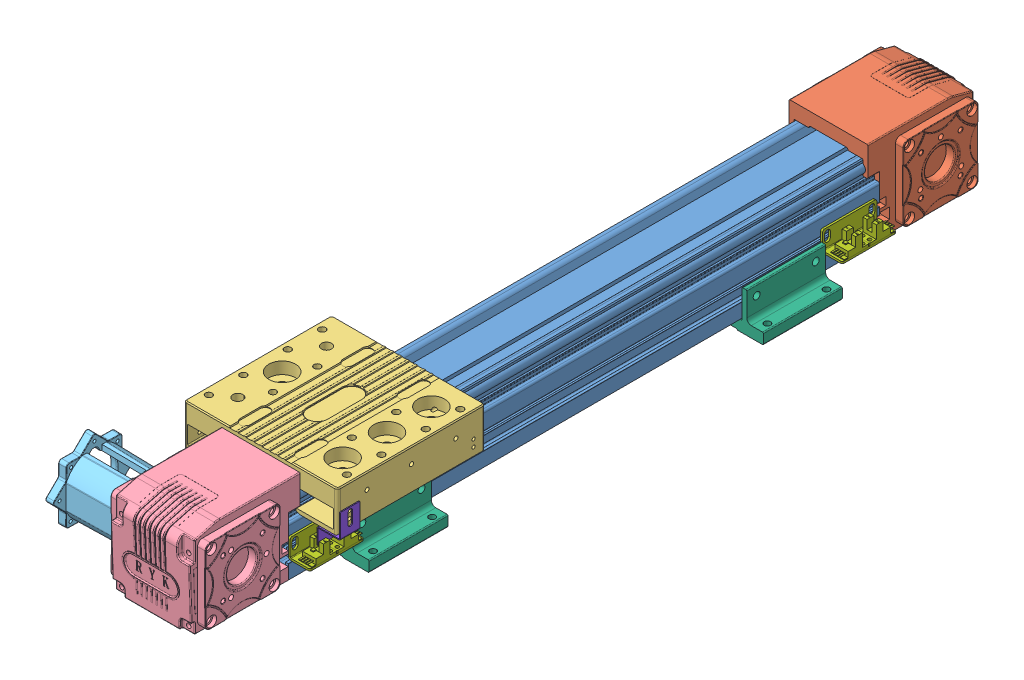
SolidWorks assembly RYK80-直连.SLDASM, configuration 默认 (file format 9000). Lengths in mm.
Overall size (189.8 105.5 803.37).
17 component instances, 12 part files, 49 mates.
Components (placement in the parent):
- RYK80欧规皮带模组型材底座-1: RYK80欧规皮带模组型材底座.SLDPRT [默认] at (-214.5114 -116.5275 500) size (80 74.5 600)
- RYK80-欧规副同步座-1: RYK80-欧规副同步座.SLDPRT [默认] at (-25.626 6.7076 546) x (-1 0 0) z (0 0 -1) size (96.14 90.46 113.69)
- RYK80欧规同步带模组滑块-1: RYK80欧规同步带模组滑块.SLDPRT [默认] at (-48.6835 40.0257 857) size (156 41.56 150)
- RYK80-欧规主同步端-1A出轴-1: RYK80-欧规主同步端-1A出轴.SLDPRT [默认] at (-45.0567 6.7076 1054) size (124.16 90.46 113.69)
- 57-60电机座-1: 57-60电机座.SLDPRT [默认] at (-86.2413 7.3679 1154) x (0 -0.008727 -0.999962) z (-1 0 0) size (83.09 83.08 62.81)
- RYK80-欧规主同步端-2B出轴-1: RYK80-欧规主同步端-2B出轴.SLDPRT [默认] at (-45.0567 6.7076 1054) (suppressed, hidden)
- 57-60电机座-3: 57-60电机座.SLDPRT [默认] at (15.5587 7.3679 1154) x (0 0.999962 0.008727) z (1 0 0) size (83.09 83.08 62.81) (suppressed, hidden)
- RYK80-欧规主同步端-双出轴-1: RYK80-欧规主同步端-双出轴.SLDPRT [默认] at (-45.0567 6.7076 1054) (suppressed, hidden)
- 57-60电机座-4: 57-60电机座.SLDPRT [默认] at (15.5587 7.3679 1154) x (0 0.999962 0.008727) z (1 0 0) size (83.09 83.08 62.81) (suppressed, hidden)
- 57-60电机座-5: 57-60电机座.SLDPRT [默认] at (-86.2413 7.3679 1154) x (0 -0.008727 -0.999962) z (-1 0 0) size (83.09 83.08 62.81) (suppressed, hidden)
- RY80欧规地脚-1: RY80欧规地脚.SLDPRT [默认] at (-35.3413 -46.6321 1040) x (0 0 -1) z (1 0 0) size (80 40 124)
- RY80欧规地脚-2: RY80欧规地脚.SLDPRT [默认] at (-35.3413 -46.6321 640) x (0 0 -1) z (1 0 0) size (80 40 124)
- RYK60 欧规光电安装座-1: RYK60 欧规光电安装座.SLDPRT [默认] at (-55.7216 6.9235 1517.0757) x (-1 0 0) z (0 0 -1) size (22 20 55.4)
- 80欧规光电感应片-1: 80欧规光电感应片.SLDPRT [默认] at (43.6587 36.8679 1066) x (0 0 1) z (-1 0 0) size (20 41 24)
- RYK60 欧规光电安装座-2: RYK60 欧规光电安装座.SLDPRT [默认] at (-55.7216 6.9235 977.0757) x (-1 0 0) z (0 0 -1) size (22 20 55.4)
- 750W电机标准转接板-1: 750W电机标准转接板.SLDPRT [默认] at (-146.1413 7.3679 1154) x (0 0.71325 0.700909) z (0 -0.700909 0.71325) (suppressed, hidden)
- 86电机转接板-M5-1: 86电机转接板-M5.SLDPRT [默认] at (-146.1413 7.3679 1154) x (0 -0.700909 0.71325) z (-1 0 0) (suppressed, hidden)
Mates (geometry in assembly coordinates):
- 重合1: coincident anti-aligned: plane of RYK80欧规皮带模组型材底座-1 through (-55.0601 28.8679 1100) normal (0 0 1); plane of RYK80-欧规主同步端-2B出轴-1 through (-35.3413 -36.6321 1100) normal (0 0 -1)
- 宽度1: width aligned: plane of RYK80欧规皮带模组型材底座-1 through (4.6586 -35.1321 1100) normal (1 0 0); plane of RYK80欧规皮带模组型材底座-1 through (-75.3413 -20.9321 1100) normal (-1 0 0); plane of RYK80-欧规主同步端-2B出轴-1 through (4.6587 -36.6321 1192) normal (1 0 0); plane of RYK80-欧规主同步端-2B出轴-1 through (-75.3413 -36.6321 1192) normal (-1 0 0)
- 重合9: coincident aligned: plane of RYK80欧规皮带模组型材底座-1 through (-63.5413 -36.6321 1100) normal (0 -1 0); plane of RYK80-欧规主同步端-2B出轴-1 through (-35.3413 -36.6321 1192) normal (0 -1 0)
- 重合10: coincident aligned: plane of RYK80欧规皮带模组型材底座-1 through (-63.5413 -36.6321 1100) normal (0 -1 0); plane of RYK80-欧规主同步端-双出轴-1 through (-35.3413 -36.6321 1192) normal (0 -1 0)
- 宽度2: width aligned: plane of RYK80欧规皮带模组型材底座-1 through (-75.3413 -20.9321 1100) normal (-1 0 0); plane of RYK80欧规皮带模组型材底座-1 through (4.6586 -35.1321 1100) normal (1 0 0); plane of RYK80-欧规主同步端-双出轴-1 through (-75.3413 -36.6321 1192) normal (-1 0 0); plane of RYK80-欧规主同步端-双出轴-1 through (4.6587 -36.6321 1192) normal (1 0 0)
- 重合11: coincident anti-aligned: plane of RYK80欧规皮带模组型材底座-1 through (-55.0601 28.8679 1100) normal (0 0 1); plane of RYK80-欧规主同步端-双出轴-1 through (-35.3413 -36.6321 1100) normal (0 0 -1)
- 重合12: coincident anti-aligned: plane of RYK80欧规皮带模组型材底座-1 through (-55.0601 28.8679 1100) normal (0 0 1); plane of RYK80-欧规主同步端-1A出轴-1 through (-35.3413 -36.6321 1100) normal (0 0 -1)
- 宽度3: width anti-aligned: plane of RYK80欧规皮带模组型材底座-1 through (4.6586 -35.1321 1100) normal (1 0 0); plane of RYK80欧规皮带模组型材底座-1 through (-75.3413 -20.9321 1100) normal (-1 0 0); plane of RYK80-欧规主同步端-1A出轴-1 through (-75.3413 -36.6321 1192) normal (-1 0 0); plane of RYK80-欧规主同步端-1A出轴-1 through (4.6587 -36.6321 1192) normal (1 0 0)
- 重合13: coincident aligned: plane of RYK80欧规皮带模组型材底座-1 through (-63.5413 -36.6321 1100) normal (0 -1 0); plane of RYK80-欧规主同步端-1A出轴-1 through (-35.3413 -36.6321 1192) normal (0 -1 0)
- 重合14: coincident anti-aligned: plane of RYK80欧规皮带模组型材底座-1 through (-55.0601 28.8679 500) normal (0 0 -1); plane of RYK80-欧规副同步座-1 through (-35.3413 -36.6321 500) normal (0 0 1)
- 重合15: coincident aligned: plane of RYK80欧规皮带模组型材底座-1 through (-21.3414 -36.6321 1100) normal (0 -1 0); plane of RYK80-欧规副同步座-1 through (-35.3413 -36.6321 408) normal (0 -1 0)
- 宽度4: width anti-aligned: plane of RYK80欧规皮带模组型材底座-1 through (4.6586 -35.1321 1100) normal (1 0 0); plane of RYK80欧规皮带模组型材底座-1 through (-75.3413 -20.9321 1100) normal (-1 0 0); plane of RYK80-欧规副同步座-1 through (-75.3413 -36.6321 408) normal (-1 0 0); plane of RYK80-欧规副同步座-1 through (4.6587 -36.6321 408) normal (1 0 0)
- 重合16: coincident anti-aligned: plane of RYK80欧规皮带模组型材底座-1 through (-63.5413 -36.6321 1100) normal (0 -1 0); plane of RY80欧规地脚-1 through (-75.4913 -36.6321 960) normal (0 1 0)
- 宽度5: width anti-aligned: plane of RY80欧规地脚-1 through (9.8087 -36.6321 960) normal (1 0 0); plane of RY80欧规地脚-1 through (-80.4913 -36.6321 960) normal (-1 0 0); plane of RYK80欧规皮带模组型材底座-1 through (-75.3413 -20.9321 1100) normal (-1 0 0); plane of RYK80欧规皮带模组型材底座-1 through (4.6586 -35.1321 1100) normal (1 0 0)
- 重合17: coincident aligned: plane of RY80欧规地脚-1 through (9.8087 -36.6321 960) normal (1 0 0); plane of RY80欧规地脚-2 through (9.8087 -36.6321 560) normal (1 0 0)
- 重合18: coincident aligned: plane of RY80欧规地脚-1 through (0.3589 -47.6321 960) normal (0 -1 0); plane of RY80欧规地脚-2 through (0.3589 -47.6321 560) normal (0 -1 0)
- 距离3: distance = 60 mm aligned: plane of RYK80欧规皮带模组型材底座-1 through (-55.0601 28.8679 1100) normal (0 0 1); plane of RY80欧规地脚-1 through (-35.3413 -46.6321 1040) normal (0 0 1)
- 距离4: distance = 60 mm aligned: plane of RYK80欧规皮带模组型材底座-1 through (-55.0601 28.8679 500) normal (0 0 -1); plane of RY80欧规地脚-2 through (-35.3413 -46.6321 560) normal (0 0 -1)
- 重合24: coincident anti-aligned: plane of RYK80欧规皮带模组型材底座-1 through (4.6586 -35.1321 1100) normal (1 0 0); plane of RYK60 欧规光电安装座-1 through (4.6586 3.3679 1045) normal (-1 0 0)
- 距离7: distance = 20 mm aligned: plane of RYK60 欧规光电安装座-1 through (4.6586 -16.6321 1045) normal (0 -1 0); plane of RYK80欧规皮带模组型材底座-1 through (-21.3414 -36.6321 1100) normal (0 -1 0)
- 重合32: coincident aligned: plane of RYK60 欧规光电安装座-1 through (4.6586 -16.6321 1045) normal (0 -1 0); plane of RYK60 欧规光电安装座-2 through (4.6586 -16.6321 505) normal (0 -1 0)
- 重合33: coincident aligned: plane of RYK60 欧规光电安装座-1 through (26.6586 -16.6321 1045) normal (1 0 0); plane of RYK60 欧规光电安装座-2 through (26.6586 -16.6321 505) normal (1 0 0)
- 距离8: distance = 5 mm aligned: plane of RYK60 欧规光电安装座-2 through (6.6586 -13.8955 505) normal (0 0 -1); plane of RYK80欧规皮带模组型材底座-1 through (-55.0601 28.8679 500) normal (0 0 -1)
- 重合35: coincident anti-aligned: plane of RYK80-欧规主同步端-1A出轴-1 through (-83.3413 7.3679 1154) normal (-1 0 0); plane of 57-60电机座-1 through (-83.3413 7.3679 1154) normal (1 0 0)
- 同心1: concentric anti-aligned: cylinder of RYK80-欧规主同步端-1A出轴-1 through (-111.3413 7.3679 1154) axis (1 0 0) radius 9.5; cone of 57-60电机座-1 through (-93.2413 7.3679 1154) axis (-1 0 0)
- 同心2: concentric anti-aligned: cylinder of RYK80-欧规主同步端-1A出轴-1 through (-83.3413 -4.6321 1174.7846) axis (-1 0 0) radius 2.5; cone of 57-60电机座-1 through (-83.2413 -4.6321 1174.7846) axis (1 0 0)
- 重合36: coincident anti-aligned: plane of 57-60电机座-1 through (-146.1413 7.3679 1154) normal (-1 0 0); plane of 750W电机标准转接板-1 through (-146.1413 7.3679 1154) normal (1 0 0)
- 同心3: concentric aligned: cone of 57-60电机座-1 through (-92.9263 7.3679 1154) axis (1 0 0); cylinder of 750W电机标准转接板-1 through (-194.1413 7.3679 1154) axis (1 0 0) radius 22.5
- 同心4: concentric aligned: cylinder of 57-60电机座-1 through (-138.2413 7.0624 1119.0013) axis (-1 0 0) radius 1.6; circle of 750W电机标准转接板-1
- 重合37: coincident anti-aligned: plane of 57-60电机座-1 through (-146.1413 7.3679 1154) normal (-1 0 0); plane of 86电机转接板-M5-1 through (-146.1413 -49.1985 1154.4936) normal (1 0 0)
- 同心5: concentric anti-aligned: cone of 57-60电机座-1 through (-92.9263 7.3679 1154) axis (1 0 0); cylinder of 86电机转接板-M5-1 through (-146.1413 7.3679 1154) axis (-1 0 0) radius 23
- 同心6: concentric aligned: cylinder of 57-60电机座-1 through (-138.2413 7.0624 1119.0013) axis (-1 0 0) radius 1.6; circle of 86电机转接板-M5-1
- 距离9: distance = 105.5 mm anti-aligned: plane of RYK80欧规同步带模组滑块-1 through (-117.8382 57.8679 940.5) normal (0 1 0); plane of RY80欧规地脚-1 through (-71.0415 -47.6321 960) normal (0 -1 0)
- 宽度6: width aligned: plane of RYK80欧规同步带模组滑块-1 through (-113.3413 35.9974 1085.5) normal (-1 0 0); plane of RYK80欧规同步带模组滑块-1 through (42.6587 17.8079 1085.5) normal (1 0 0); plane of RYK80欧规皮带模组型材底座-1 through (-75.3413 -20.9321 1100) normal (-1 0 0); plane of RYK80欧规皮带模组型材底座-1 through (4.6586 -35.1321 1100) normal (1 0 0)
- 重合39: coincident anti-aligned: plane of RYK80欧规同步带模组滑块-1 through (-104.3413 47.7679 1088) normal (0 0 1); plane of RYK80-欧规主同步端-1A出轴-1 through (-35.3413 38.3679 1088) normal (0 0 -1)
- 重合40: coincident anti-aligned: plane of RYK80欧规同步带模组滑块-1 through (42.6587 17.8079 1085.5) normal (1 0 0); plane of 80欧规光电感应片-1 through (42.6587 36.8679 1086) normal (-1 0 0)
- 距离10: distance = 2 mm aligned: plane of 80欧规光电感应片-1 through (21.3953 11.1313 1086) normal (0 0 1); plane of RYK80欧规同步带模组滑块-1 through (-104.3413 47.7679 1088) normal (0 0 1)
- 距离11: distance = 21 mm aligned: plane of 80欧规光电感应片-1 through (42.6587 36.8679 1086) normal (0 1 0); plane of RYK80欧规同步带模组滑块-1 through (-117.8382 57.8679 940.5) normal (0 1 0)
- 重合44: coincident anti-aligned: plane of RYK80欧规同步带模组滑块-1 through (-104.3413 47.7679 1088) normal (0 0 1); plane of RYK80-欧规主同步端-2B出轴-1 through (-35.3413 38.3679 1088) normal (0 0 -1)
- 重合45: coincident anti-aligned: plane of RYK80-欧规主同步端-2B出轴-1 through (12.6587 7.3679 1154) normal (1 0 0); plane of 57-60电机座-3 through (12.6587 7.3679 1154) normal (-1 0 0)
- 同心7: concentric anti-aligned: cylinder of RYK80-欧规主同步端-2B出轴-1 through (40.6587 7.3679 1154) axis (-1 0 0) radius 9.5; cone of 57-60电机座-3 through (22.5587 7.3679 1154) axis (1 0 0)
- 同心8: concentric anti-aligned: cylinder of RYK80-欧规主同步端-2B出轴-1 through (12.6587 -13.4168 1166) axis (1 0 0) radius 2.5; cone of 57-60电机座-3 through (12.5587 -13.4168 1166) axis (-1 0 0)
- 重合46: coincident anti-aligned: plane of RYK80-欧规主同步端-双出轴-1 through (12.6587 7.3679 1154) normal (1 0 0); plane of 57-60电机座-4 through (12.6587 7.3679 1154) normal (-1 0 0)
- 同心9: concentric aligned: cylinder of RYK80-欧规主同步端-双出轴-1 through (40.6587 7.3679 1154) axis (-1 0 0) radius 9.5; cone of 57-60电机座-4 through (22.2436 7.3679 1154) axis (-1 0 0)
- 重合47: coincident anti-aligned: plane of RYK80-欧规主同步端-双出轴-1 through (-83.3413 7.3679 1154) normal (-1 0 0); plane of 57-60电机座-5 through (-83.3413 7.3679 1154) normal (1 0 0)
- 同心10: concentric anti-aligned: cylinder of RYK80-欧规主同步端-双出轴-1 through (-111.3413 7.3679 1154) axis (1 0 0) radius 9.5; cone of 57-60电机座-5 through (-93.2413 7.3679 1154) axis (-1 0 0)
- 同心11: concentric anti-aligned: cylinder of RYK80-欧规主同步端-双出轴-1 through (-83.3413 -4.6321 1133.2154) axis (-1 0 0) radius 2.5; cone of 57-60电机座-5 through (-83.2413 -4.6321 1133.2154) axis (1 0 0)
- 重合48: coincident anti-aligned: plane of RYK80欧规同步带模组滑块-1 through (-104.3413 47.7679 1088) normal (0 0 1); plane of RYK80-欧规主同步端-双出轴-1 through (-35.3413 38.3679 1088) normal (0 0 -1)
- 重合49: coincident aligned: plane of RYK80欧规皮带模组型材底座-1 through (-55.0601 28.8679 1100) normal (0 0 1); plane of RYK60 欧规光电安装座-1 through (7.3952 -13.8955 1100) normal (0 0 1)
